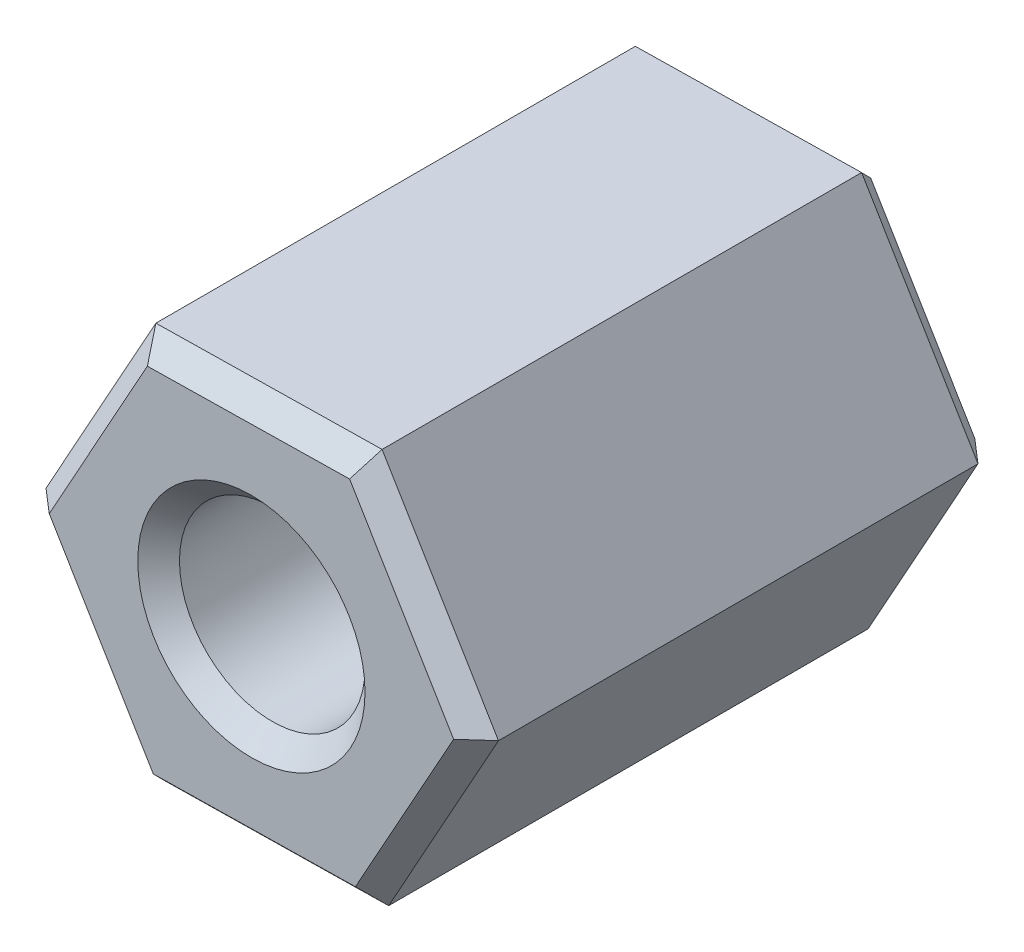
ISO-10303-21;
HEADER;
FILE_DESCRIPTION(('STEP AP214'),'2;1');
FILE_NAME('part.step','',(''),(''),'','','');
FILE_SCHEMA(('AUTOMOTIVE_DESIGN { 1 0 10303 214 1 1 1 1 }'));
ENDSEC;
DATA;
#1=APPLICATION_CONTEXT('core data for automotive mechanical design processes');
#2=APPLICATION_PROTOCOL_DEFINITION('international standard','automotive_design',2000,#1);
#3=PRODUCT_CONTEXT('',#1,'mechanical');
#4=PRODUCT('Part','Part','',(#3));
#5=PRODUCT_RELATED_PRODUCT_CATEGORY('part','',(#4));
#6=PRODUCT_DEFINITION_FORMATION('','',#4);
#7=PRODUCT_DEFINITION_CONTEXT('part definition',#1,'design');
#8=PRODUCT_DEFINITION('design','',#6,#7);
#9=PRODUCT_DEFINITION_SHAPE('','',#8);
#10=(LENGTH_UNIT() NAMED_UNIT(*) SI_UNIT(.MILLI.,.METRE.));
#11=(NAMED_UNIT(*) PLANE_ANGLE_UNIT() SI_UNIT($,.RADIAN.));
#12=(NAMED_UNIT(*) SI_UNIT($,.STERADIAN.) SOLID_ANGLE_UNIT());
#13=UNCERTAINTY_MEASURE_WITH_UNIT(LENGTH_MEASURE(1.E-05),#10,'distance_accuracy_value','');
#14=(GEOMETRIC_REPRESENTATION_CONTEXT(3) GLOBAL_UNCERTAINTY_ASSIGNED_CONTEXT((#13)) GLOBAL_UNIT_ASSIGNED_CONTEXT((#10,
#11,#12)) REPRESENTATION_CONTEXT('',''));
#15=CARTESIAN_POINT('',(0.,0.,0.));
#16=DIRECTION('',(0.,0.,1.));
#17=DIRECTION('',(1.,0.,0.));
#18=AXIS2_PLACEMENT_3D('',#15,#16,#17);
#19=CARTESIAN_POINT('',(1.41824271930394,-2.36419808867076,6.34999999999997));
#20=DIRECTION('',(-0.874271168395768,0.485437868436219,0.));
#21=DIRECTION('',(-0.485437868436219,-0.874271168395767,0.));
#22=AXIS2_PLACEMENT_3D('',#19,#20,#21);
#23=PLANE('',#22);
#24=DIRECTION('',(0.,0.,-1.));
#25=VECTOR('',#24,1.);
#26=CARTESIAN_POINT('',(1.41824271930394,-2.36419808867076,6.34999999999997));
#27=LINE('',#26,#25);
#28=CARTESIAN_POINT('',(1.41824271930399,-2.36419808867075,6.096));
#29=VERTEX_POINT('',#28);
#30=CARTESIAN_POINT('',(1.41824271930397,-2.36419808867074,0.254000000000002));
#31=VERTEX_POINT('',#30);
#32=EDGE_CURVE('E177',#29,#31,#27,.T.);
#33=ORIENTED_EDGE('',*,*,#32,.T.);
#34=DIRECTION('',(0.485437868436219,0.874271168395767,0.));
#35=VECTOR('',#34,1.);
#36=CARTESIAN_POINT('',(1.41824271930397,-2.36419808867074,0.254000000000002));
#37=LINE('',#36,#35);
#38=CARTESIAN_POINT('',(2.75657696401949,0.046135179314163,0.253999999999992));
#39=VERTEX_POINT('',#38);
#40=EDGE_CURVE('E207',#31,#39,#37,.T.);
#41=ORIENTED_EDGE('',*,*,#40,.T.);
#42=DIRECTION('',(0.,0.,-1.));
#43=VECTOR('',#42,1.);
#44=CARTESIAN_POINT('',(2.75657696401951,0.0461351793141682,6.35000000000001));
#45=LINE('',#44,#43);
#46=CARTESIAN_POINT('',(2.75657696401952,0.0461351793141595,6.096));
#47=VERTEX_POINT('',#46);
#48=EDGE_CURVE('E143',#47,#39,#45,.T.);
#49=ORIENTED_EDGE('',*,*,#48,.F.);
#50=DIRECTION('',(-0.485437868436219,-0.874271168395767,0.));
#51=VECTOR('',#50,1.);
#52=CARTESIAN_POINT('',(1.41824271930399,-2.36419808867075,6.096));
#53=LINE('',#52,#51);
#54=EDGE_CURVE('E163',#47,#29,#53,.T.);
#55=ORIENTED_EDGE('',*,*,#54,.T.);
#56=EDGE_LOOP('',(#33,#41,#49,#55));
#57=FACE_BOUND('',#56,.T.);
#58=ADVANCED_FACE('F32',(#57),#23,.F.);
#59=CARTESIAN_POINT('',(2.75657696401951,0.0461351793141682,6.35000000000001));
#60=DIRECTION('',(-0.857537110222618,-0.514422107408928,0.));
#61=DIRECTION('',(0.514422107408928,-0.857537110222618,0.));
#62=AXIS2_PLACEMENT_3D('',#59,#60,#61);
#63=PLANE('',#62);
#64=ORIENTED_EDGE('',*,*,#48,.T.);
#65=DIRECTION('',(-0.514422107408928,0.857537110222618,0.));
#66=VECTOR('',#65,1.);
#67=CARTESIAN_POINT('',(2.75657696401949,0.046135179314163,0.253999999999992));
#68=LINE('',#67,#66);
#69=CARTESIAN_POINT('',(1.33833424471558,2.41033326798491,0.253999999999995));
#70=VERTEX_POINT('',#69);
#71=EDGE_CURVE('E205',#39,#70,#68,.T.);
#72=ORIENTED_EDGE('',*,*,#71,.T.);
#73=DIRECTION('',(0.,0.,-1.));
#74=VECTOR('',#73,1.);
#75=CARTESIAN_POINT('',(1.33833424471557,2.41033326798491,6.35000000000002));
#76=LINE('',#75,#74);
#77=CARTESIAN_POINT('',(1.33833424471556,2.41033326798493,6.09600000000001));
#78=VERTEX_POINT('',#77);
#79=EDGE_CURVE('E251',#78,#70,#76,.T.);
#80=ORIENTED_EDGE('',*,*,#79,.F.);
#81=DIRECTION('',(0.514422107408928,-0.857537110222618,0.));
#82=VECTOR('',#81,1.);
#83=CARTESIAN_POINT('',(2.75657696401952,0.0461351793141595,6.096));
#84=LINE('',#83,#82);
#85=EDGE_CURVE('E161',#78,#47,#84,.T.);
#86=ORIENTED_EDGE('',*,*,#85,.T.);
#87=EDGE_LOOP('',(#64,#72,#80,#86));
#88=FACE_BOUND('',#87,.T.);
#89=ADVANCED_FACE('F250',(#88),#63,.F.);
#90=CARTESIAN_POINT('',(1.33833424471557,2.41033326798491,6.35000000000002));
#91=DIRECTION('',(0.016734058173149,-0.999859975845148,0.));
#92=DIRECTION('',(0.999859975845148,0.0167340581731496,0.));
#93=AXIS2_PLACEMENT_3D('',#90,#91,#92);
#94=PLANE('',#93);
#95=ORIENTED_EDGE('',*,*,#79,.T.);
#96=DIRECTION('',(-0.999859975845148,-0.0167340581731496,0.));
#97=VECTOR('',#96,1.);
#98=CARTESIAN_POINT('',(1.33833424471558,2.41033326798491,0.253999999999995));
#99=LINE('',#98,#97);
#100=CARTESIAN_POINT('',(-1.41824271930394,2.36419808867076,0.253999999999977));
#101=VERTEX_POINT('',#100);
#102=EDGE_CURVE('E202',#70,#101,#99,.T.);
#103=ORIENTED_EDGE('',*,*,#102,.T.);
#104=DIRECTION('',(0.,0.,-1.));
#105=VECTOR('',#104,1.);
#106=CARTESIAN_POINT('',(-1.41824271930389,2.36419808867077,6.35000000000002));
#107=LINE('',#106,#105);
#108=CARTESIAN_POINT('',(-1.4182427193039,2.36419808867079,6.096));
#109=VERTEX_POINT('',#108);
#110=EDGE_CURVE('E258',#109,#101,#107,.T.);
#111=ORIENTED_EDGE('',*,*,#110,.F.);
#112=DIRECTION('',(0.999859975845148,0.0167340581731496,0.));
#113=VECTOR('',#112,1.);
#114=CARTESIAN_POINT('',(1.33833424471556,2.41033326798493,6.09600000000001));
#115=LINE('',#114,#113);
#116=EDGE_CURVE('E159',#109,#78,#115,.T.);
#117=ORIENTED_EDGE('',*,*,#116,.T.);
#118=EDGE_LOOP('',(#95,#103,#111,#117));
#119=FACE_BOUND('',#118,.T.);
#120=ADVANCED_FACE('F255',(#119),#94,.F.);
#121=CARTESIAN_POINT('',(-1.41824271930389,2.36419808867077,6.35000000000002));
#122=DIRECTION('',(0.874271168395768,-0.485437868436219,0.));
#123=DIRECTION('',(0.485437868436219,0.874271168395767,0.));
#124=AXIS2_PLACEMENT_3D('',#121,#122,#123);
#125=PLANE('',#124);
#126=ORIENTED_EDGE('',*,*,#110,.T.);
#127=DIRECTION('',(-0.485437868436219,-0.874271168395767,0.));
#128=VECTOR('',#127,1.);
#129=CARTESIAN_POINT('',(-1.41824271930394,2.36419808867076,0.253999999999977));
#130=LINE('',#129,#128);
#131=CARTESIAN_POINT('',(-2.75657696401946,-0.0461351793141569,0.254000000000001));
#132=VERTEX_POINT('',#131);
#133=EDGE_CURVE('E11',#101,#132,#130,.T.);
#134=ORIENTED_EDGE('',*,*,#133,.T.);
#135=DIRECTION('',(0.,0.,-1.));
#136=VECTOR('',#135,1.);
#137=CARTESIAN_POINT('',(-2.75657696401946,-0.0461351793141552,6.35));
#138=LINE('',#137,#136);
#139=CARTESIAN_POINT('',(-2.75657696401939,-0.046135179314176,6.096));
#140=VERTEX_POINT('',#139);
#141=EDGE_CURVE('E261',#140,#132,#138,.T.);
#142=ORIENTED_EDGE('',*,*,#141,.F.);
#143=DIRECTION('',(0.485437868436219,0.874271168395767,0.));
#144=VECTOR('',#143,1.);
#145=CARTESIAN_POINT('',(-1.4182427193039,2.36419808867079,6.096));
#146=LINE('',#145,#144);
#147=EDGE_CURVE('E157',#140,#109,#146,.T.);
#148=ORIENTED_EDGE('',*,*,#147,.T.);
#149=EDGE_LOOP('',(#126,#134,#142,#148));
#150=FACE_BOUND('',#149,.T.);
#151=ADVANCED_FACE('F455',(#150),#125,.F.);
#152=CARTESIAN_POINT('',(-2.75657696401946,-0.0461351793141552,6.35));
#153=DIRECTION('',(0.857537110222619,0.514422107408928,0.));
#154=DIRECTION('',(-0.514422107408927,0.857537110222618,0.));
#155=AXIS2_PLACEMENT_3D('',#152,#153,#154);
#156=PLANE('',#155);
#157=ORIENTED_EDGE('',*,*,#141,.T.);
#158=DIRECTION('',(0.514422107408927,-0.857537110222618,0.));
#159=VECTOR('',#158,1.);
#160=CARTESIAN_POINT('',(-2.75657696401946,-0.0461351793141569,0.254000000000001));
#161=LINE('',#160,#159);
#162=CARTESIAN_POINT('',(-1.33833424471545,-2.41033326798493,0.253999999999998));
#163=VERTEX_POINT('',#162);
#164=EDGE_CURVE('E41',#132,#163,#161,.T.);
#165=ORIENTED_EDGE('',*,*,#164,.T.);
#166=DIRECTION('',(0.,0.,-1.));
#167=VECTOR('',#166,1.);
#168=CARTESIAN_POINT('',(-1.33833424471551,-2.41033326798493,6.35));
#169=LINE('',#168,#167);
#170=CARTESIAN_POINT('',(-1.33833424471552,-2.41033326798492,6.09599999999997));
#171=VERTEX_POINT('',#170);
#172=EDGE_CURVE('E280',#171,#163,#169,.T.);
#173=ORIENTED_EDGE('',*,*,#172,.F.);
#174=DIRECTION('',(-0.514422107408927,0.857537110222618,0.));
#175=VECTOR('',#174,1.);
#176=CARTESIAN_POINT('',(-2.75657696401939,-0.046135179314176,6.096));
#177=LINE('',#176,#175);
#178=EDGE_CURVE('E150',#171,#140,#177,.T.);
#179=ORIENTED_EDGE('',*,*,#178,.T.);
#180=EDGE_LOOP('',(#157,#165,#173,#179));
#181=FACE_BOUND('',#180,.T.);
#182=ADVANCED_FACE('F282',(#181),#156,.F.);
#183=CARTESIAN_POINT('',(-1.33833424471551,-2.41033326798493,6.35));
#184=DIRECTION('',(-0.016734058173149,0.999859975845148,0.));
#185=DIRECTION('',(-0.999859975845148,-0.01673405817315,0.));
#186=AXIS2_PLACEMENT_3D('',#183,#184,#185);
#187=PLANE('',#186);
#188=ORIENTED_EDGE('',*,*,#172,.T.);
#189=DIRECTION('',(0.999859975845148,0.01673405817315,0.));
#190=VECTOR('',#189,1.);
#191=CARTESIAN_POINT('',(-1.33833424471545,-2.41033326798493,0.253999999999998));
#192=LINE('',#191,#190);
#193=EDGE_CURVE('E209',#163,#31,#192,.T.);
#194=ORIENTED_EDGE('',*,*,#193,.T.);
#195=ORIENTED_EDGE('',*,*,#32,.F.);
#196=DIRECTION('',(-0.999859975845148,-0.01673405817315,0.));
#197=VECTOR('',#196,1.);
#198=CARTESIAN_POINT('',(-1.33833424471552,-2.41033326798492,6.09599999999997));
#199=LINE('',#198,#197);
#200=EDGE_CURVE('E130',#29,#171,#199,.T.);
#201=ORIENTED_EDGE('',*,*,#200,.T.);
#202=EDGE_LOOP('',(#188,#194,#195,#201));
#203=FACE_BOUND('',#202,.T.);
#204=ADVANCED_FACE('F279',(#203),#187,.F.);
#205=CARTESIAN_POINT('',(2.75657696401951,0.0461351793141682,6.35000000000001));
#206=DIRECTION('',(0.,0.,1.));
#207=DIRECTION('',(1.,0.,0.));
#208=AXIS2_PLACEMENT_3D('',#205,#206,#207);
#209=PLANE('',#208);
#210=CARTESIAN_POINT('',(0.,0.,6.35));
#211=DIRECTION('',(0.,0.,1.));
#212=DIRECTION('',(1.,0.,0.));
#213=AXIS2_PLACEMENT_3D('',#210,#211,#212);
#214=CIRCLE('',#213,1.3843);
#215=CARTESIAN_POINT('',(1.3843,0.,6.35));
#216=VERTEX_POINT('',#215);
#217=EDGE_CURVE('E164',#216,#216,#214,.F.);
#218=ORIENTED_EDGE('',*,*,#217,.T.);
#219=EDGE_LOOP('',(#218));
#220=FACE_BOUND('',#219,.T.);
#221=DIRECTION('',(0.514422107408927,-0.857537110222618,0.));
#222=VECTOR('',#221,1.);
#223=CARTESIAN_POINT('',(-1.12051981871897,-2.27967005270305,6.34999999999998));
#224=LINE('',#223,#222);
#225=CARTESIAN_POINT('',(-2.46332409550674,-0.0412271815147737,6.35));
#226=VERTEX_POINT('',#225);
#227=CARTESIAN_POINT('',(-1.19595826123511,-2.15391483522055,6.35000000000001));
#228=VERTEX_POINT('',#227);
#229=EDGE_CURVE('E147',#226,#228,#224,.T.);
#230=ORIENTED_EDGE('',*,*,#229,.T.);
#231=DIRECTION('',(0.999859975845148,0.01673405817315,0.));
#232=VECTOR('',#231,1.);
#233=CARTESIAN_POINT('',(1.41399226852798,-2.11023365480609,6.35000000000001));
#234=LINE('',#233,#232);
#235=CARTESIAN_POINT('',(1.26736583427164,-2.11268765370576,6.35));
#236=VERTEX_POINT('',#235);
#237=EDGE_CURVE('E128',#228,#236,#234,.T.);
#238=ORIENTED_EDGE('',*,*,#237,.T.);
#239=DIRECTION('',(0.485437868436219,0.874271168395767,0.));
#240=VECTOR('',#239,1.);
#241=CARTESIAN_POINT('',(2.53451208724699,0.169436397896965,6.35));
#242=LINE('',#241,#240);
#243=CARTESIAN_POINT('',(2.46332409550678,0.0412271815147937,6.35));
#244=VERTEX_POINT('',#243);
#245=EDGE_CURVE('E136',#236,#244,#242,.T.);
#246=ORIENTED_EDGE('',*,*,#245,.T.);
#247=DIRECTION('',(-0.514422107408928,0.857537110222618,0.));
#248=VECTOR('',#247,1.);
#249=CARTESIAN_POINT('',(1.12051981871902,2.27967005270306,6.35));
#250=LINE('',#249,#248);
#251=CARTESIAN_POINT('',(1.19595826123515,2.15391483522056,6.35));
#252=VERTEX_POINT('',#251);
#253=EDGE_CURVE('E142',#244,#252,#250,.T.);
#254=ORIENTED_EDGE('',*,*,#253,.T.);
#255=DIRECTION('',(-0.999859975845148,-0.0167340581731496,0.));
#256=VECTOR('',#255,1.);
#257=CARTESIAN_POINT('',(-1.41399226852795,2.11023365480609,6.35));
#258=LINE('',#257,#256);
#259=CARTESIAN_POINT('',(-1.26736583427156,2.1126876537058,6.35));
#260=VERTEX_POINT('',#259);
#261=EDGE_CURVE('E266',#252,#260,#258,.T.);
#262=ORIENTED_EDGE('',*,*,#261,.T.);
#263=DIRECTION('',(-0.485437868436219,-0.874271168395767,0.));
#264=VECTOR('',#263,1.);
#265=CARTESIAN_POINT('',(-2.53451208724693,-0.169436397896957,6.35));
#266=LINE('',#265,#264);
#267=EDGE_CURVE('E152',#260,#226,#266,.T.);
#268=ORIENTED_EDGE('',*,*,#267,.T.);
#269=EDGE_LOOP('',(#230,#238,#246,#254,#262,#268));
#270=FACE_BOUND('',#269,.T.);
#271=ADVANCED_FACE('F145',(#220,#270),#209,.T.);
#272=CARTESIAN_POINT('',(2.75657696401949,0.046135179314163,0.));
#273=DIRECTION('',(0.,0.,1.));
#274=DIRECTION('',(1.,0.,0.));
#275=AXIS2_PLACEMENT_3D('',#272,#273,#274);
#276=PLANE('',#275);
#277=CARTESIAN_POINT('',(0.,0.,0.));
#278=DIRECTION('',(0.,0.,1.));
#279=DIRECTION('',(1.,0.,0.));
#280=AXIS2_PLACEMENT_3D('',#277,#278,#279);
#281=CIRCLE('',#280,1.38429999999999);
#282=CARTESIAN_POINT('',(1.38429999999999,0.,0.));
#283=VERTEX_POINT('',#282);
#284=EDGE_CURVE('E199',#283,#283,#281,.T.);
#285=ORIENTED_EDGE('',*,*,#284,.T.);
#286=EDGE_LOOP('',(#285));
#287=FACE_BOUND('',#286,.T.);
#288=DIRECTION('',(0.485437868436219,0.874271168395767,0.));
#289=VECTOR('',#288,1.);
#290=CARTESIAN_POINT('',(-1.19617784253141,2.24089687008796,0.));
#291=LINE('',#290,#289);
#292=CARTESIAN_POINT('',(-2.4633240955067,-0.0412271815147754,0.));
#293=VERTEX_POINT('',#292);
#294=CARTESIAN_POINT('',(-1.26736583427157,2.1126876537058,0.));
#295=VERTEX_POINT('',#294);
#296=EDGE_CURVE('E186',#293,#295,#291,.T.);
#297=ORIENTED_EDGE('',*,*,#296,.T.);
#298=DIRECTION('',(0.999859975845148,0.0167340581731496,0.));
#299=VECTOR('',#298,1.);
#300=CARTESIAN_POINT('',(2.72087317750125,2.17943642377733,0.));
#301=LINE('',#300,#299);
#302=CARTESIAN_POINT('',(1.19595826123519,2.15391483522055,0.));
#303=VERTEX_POINT('',#302);
#304=EDGE_CURVE('E196',#295,#303,#301,.T.);
#305=ORIENTED_EDGE('',*,*,#304,.T.);
#306=DIRECTION('',(0.514422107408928,-0.857537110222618,0.));
#307=VECTOR('',#306,1.);
#308=CARTESIAN_POINT('',(2.53876253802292,-0.0845280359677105,0.));
#309=LINE('',#308,#307);
#310=CARTESIAN_POINT('',(2.46332409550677,0.0412271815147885,0.));
#311=VERTEX_POINT('',#310);
#312=EDGE_CURVE('E194',#303,#311,#309,.T.);
#313=ORIENTED_EDGE('',*,*,#312,.T.);
#314=DIRECTION('',(-0.485437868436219,-0.874271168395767,0.));
#315=VECTOR('',#314,1.);
#316=CARTESIAN_POINT('',(2.53451208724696,0.169436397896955,0.));
#317=LINE('',#316,#315);
#318=CARTESIAN_POINT('',(1.2673658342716,-2.11268765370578,0.));
#319=VERTEX_POINT('',#318);
#320=EDGE_CURVE('E192',#311,#319,#317,.T.);
#321=ORIENTED_EDGE('',*,*,#320,.T.);
#322=DIRECTION('',(-0.999859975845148,-0.01673405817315,0.));
#323=VECTOR('',#322,1.);
#324=CARTESIAN_POINT('',(2.79228075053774,-2.087166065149,0.));
#325=LINE('',#324,#323);
#326=CARTESIAN_POINT('',(-1.19595826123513,-2.15391483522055,0.));
#327=VERTEX_POINT('',#326);
#328=EDGE_CURVE('E190',#319,#327,#325,.T.);
#329=ORIENTED_EDGE('',*,*,#328,.T.);
#330=DIRECTION('',(-0.514422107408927,0.857537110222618,0.));
#331=VECTOR('',#330,1.);
#332=CARTESIAN_POINT('',(-1.12051981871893,-2.27967005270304,0.));
#333=LINE('',#332,#331);
#334=EDGE_CURVE('E188',#327,#293,#333,.T.);
#335=ORIENTED_EDGE('',*,*,#334,.T.);
#336=EDGE_LOOP('',(#297,#305,#313,#321,#329,#335));
#337=FACE_BOUND('',#336,.T.);
#338=ADVANCED_FACE('F237',(#287,#337),#276,.F.);
#339=CARTESIAN_POINT('',(0.,0.,0.));
#340=DIRECTION('',(0.,0.,-1.));
#341=DIRECTION('',(-1.,0.,0.));
#342=AXIS2_PLACEMENT_3D('',#339,#340,#341);
#343=CYLINDRICAL_SURFACE('',#342,1.13029999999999);
#344=CARTESIAN_POINT('',(0.,0.,0.253999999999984));
#345=DIRECTION('',(0.,0.,1.));
#346=DIRECTION('',(1.,0.,0.));
#347=AXIS2_PLACEMENT_3D('',#344,#345,#346);
#348=CIRCLE('',#347,1.13029999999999);
#349=CARTESIAN_POINT('',(1.13030000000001,0.,0.253999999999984));
#350=VERTEX_POINT('',#349);
#351=EDGE_CURVE('E183',#350,#350,#348,.F.);
#352=ORIENTED_EDGE('',*,*,#351,.T.);
#353=EDGE_LOOP('',(#352));
#354=FACE_BOUND('',#353,.T.);
#355=CARTESIAN_POINT('',(0.,0.,6.09599999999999));
#356=DIRECTION('',(0.,0.,1.));
#357=DIRECTION('',(1.,0.,0.));
#358=AXIS2_PLACEMENT_3D('',#355,#356,#357);
#359=CIRCLE('',#358,1.13029999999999);
#360=CARTESIAN_POINT('',(1.13030000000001,0.,6.09599999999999));
#361=VERTEX_POINT('',#360);
#362=EDGE_CURVE('E180',#361,#361,#359,.T.);
#363=ORIENTED_EDGE('',*,*,#362,.T.);
#364=EDGE_LOOP('',(#363));
#365=FACE_BOUND('',#364,.T.);
#366=ADVANCED_FACE('F292',(#354,#365),#343,.F.);
#367=CARTESIAN_POINT('',(2.72087317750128,2.17943642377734,6.34999999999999));
#368=DIRECTION('',(-0.0118327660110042,0.707007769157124,0.707106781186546));
#369=DIRECTION('',(0.,-0.707156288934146,0.707057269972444));
#370=AXIS2_PLACEMENT_3D('',#367,#368,#369);
#371=PLANE('',#370);
#372=DIRECTION('',(-0.366956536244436,-0.660886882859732,0.654653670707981));
#373=VECTOR('',#372,1.);
#374=CARTESIAN_POINT('',(0.833916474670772,1.5018793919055,6.99588571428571));
#375=LINE('',#374,#373);
#376=EDGE_CURVE('E171',#78,#252,#375,.T.);
#377=ORIENTED_EDGE('',*,*,#376,.F.);
#378=ORIENTED_EDGE('',*,*,#116,.F.);
#379=DIRECTION('',(0.388866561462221,-0.648237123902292,0.654653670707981));
#380=VECTOR('',#379,1.);
#381=CARTESIAN_POINT('',(-0.681101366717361,1.1353899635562,7.33697142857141));
#382=LINE('',#381,#380);
#383=EDGE_CURVE('E174',#260,#109,#382,.F.);
#384=ORIENTED_EDGE('',*,*,#383,.F.);
#385=ORIENTED_EDGE('',*,*,#261,.F.);
#386=EDGE_LOOP('',(#377,#378,#384,#385));
#387=FACE_BOUND('',#386,.T.);
#388=ADVANCED_FACE('F290',(#387),#371,.T.);
#389=CARTESIAN_POINT('',(-1.19617784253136,2.24089687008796,6.35));
#390=DIRECTION('',(-0.618203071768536,0.343256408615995,0.707106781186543));
#391=DIRECTION('',(0.752848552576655,0.,0.658193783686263));
#392=AXIS2_PLACEMENT_3D('',#389,#390,#391);
#393=PLANE('',#392);
#394=ORIENTED_EDGE('',*,*,#383,.T.);
#395=ORIENTED_EDGE('',*,*,#147,.F.);
#396=DIRECTION('',(0.755823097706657,0.0126497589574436,0.654653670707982));
#397=VECTOR('',#396,1.);
#398=CARTESIAN_POINT('',(-1.71762394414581,-0.028746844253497,6.9958857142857));
#399=LINE('',#398,#397);
#400=EDGE_CURVE('E168',#226,#140,#399,.F.);
#401=ORIENTED_EDGE('',*,*,#400,.F.);
#402=ORIENTED_EDGE('',*,*,#267,.F.);
#403=EDGE_LOOP('',(#394,#395,#401,#402));
#404=FACE_BOUND('',#403,.T.);
#405=ADVANCED_FACE('F273',(#404),#393,.T.);
#406=CARTESIAN_POINT('',(2.53876253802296,-0.0845280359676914,6.35));
#407=DIRECTION('',(0.606370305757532,0.363751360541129,0.707106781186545));
#408=DIRECTION('',(0.75910870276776,0.,-0.65096388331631));
#409=AXIS2_PLACEMENT_3D('',#406,#407,#408);
#410=PLANE('',#409);
#411=ORIENTED_EDGE('',*,*,#376,.T.);
#412=ORIENTED_EDGE('',*,*,#253,.F.);
#413=DIRECTION('',(-0.755823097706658,-0.0126497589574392,0.65465367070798));
#414=VECTOR('',#413,1.);
#415=CARTESIAN_POINT('',(2.50521736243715,0.0419283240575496,6.31371428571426));
#416=LINE('',#415,#414);
#417=EDGE_CURVE('E139',#47,#244,#416,.T.);
#418=ORIENTED_EDGE('',*,*,#417,.F.);
#419=ORIENTED_EDGE('',*,*,#85,.F.);
#420=EDGE_LOOP('',(#411,#412,#418,#419));
#421=FACE_BOUND('',#420,.T.);
#422=ADVANCED_FACE('F288',(#421),#410,.T.);
#423=CARTESIAN_POINT('',(-1.12051981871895,-2.27967005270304,6.34999999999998));
#424=DIRECTION('',(-0.606370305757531,-0.363751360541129,0.707106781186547));
#425=DIRECTION('',(0.759108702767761,0.,0.650963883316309));
#426=AXIS2_PLACEMENT_3D('',#423,#424,#425);
#427=PLANE('',#426);
#428=ORIENTED_EDGE('',*,*,#400,.T.);
#429=ORIENTED_EDGE('',*,*,#178,.F.);
#430=DIRECTION('',(0.366956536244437,0.660886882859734,0.654653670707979));
#431=VECTOR('',#430,1.);
#432=CARTESIAN_POINT('',(-1.2162976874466,-2.19054603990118,6.31371428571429));
#433=LINE('',#432,#431);
#434=EDGE_CURVE('E133',#228,#171,#433,.F.);
#435=ORIENTED_EDGE('',*,*,#434,.F.);
#436=ORIENTED_EDGE('',*,*,#229,.F.);
#437=EDGE_LOOP('',(#428,#429,#435,#436));
#438=FACE_BOUND('',#437,.T.);
#439=ADVANCED_FACE('F276',(#438),#427,.T.);
#440=CARTESIAN_POINT('',(2.53451208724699,0.169436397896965,6.35));
#441=DIRECTION('',(0.618203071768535,-0.343256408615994,0.707106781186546));
#442=DIRECTION('',(0.752848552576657,0.,-0.658193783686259));
#443=AXIS2_PLACEMENT_3D('',#440,#441,#442);
#444=PLANE('',#443);
#445=ORIENTED_EDGE('',*,*,#417,.T.);
#446=ORIENTED_EDGE('',*,*,#245,.F.);
#447=DIRECTION('',(0.388866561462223,-0.648237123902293,-0.654653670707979));
#448=VECTOR('',#447,1.);
#449=CARTESIAN_POINT('',(0.883707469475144,-1.47313254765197,6.9958857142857));
#450=LINE('',#449,#448);
#451=EDGE_CURVE('E124',#29,#236,#450,.F.);
#452=ORIENTED_EDGE('',*,*,#451,.F.);
#453=ORIENTED_EDGE('',*,*,#54,.F.);
#454=EDGE_LOOP('',(#445,#446,#452,#453));
#455=FACE_BOUND('',#454,.T.);
#456=ADVANCED_FACE('F137',(#455),#444,.T.);
#457=CARTESIAN_POINT('',(2.79228075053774,-2.087166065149,6.35000000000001));
#458=DIRECTION('',(0.0118327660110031,-0.707007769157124,0.707106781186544));
#459=DIRECTION('',(0.,-0.707156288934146,-0.707057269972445));
#460=AXIS2_PLACEMENT_3D('',#457,#458,#459);
#461=PLANE('',#460);
#462=ORIENTED_EDGE('',*,*,#434,.T.);
#463=ORIENTED_EDGE('',*,*,#200,.F.);
#464=ORIENTED_EDGE('',*,*,#451,.T.);
#465=ORIENTED_EDGE('',*,*,#237,.F.);
#466=EDGE_LOOP('',(#462,#463,#464,#465));
#467=FACE_BOUND('',#466,.T.);
#468=ADVANCED_FACE('F126',(#467),#461,.T.);
#469=CARTESIAN_POINT('',(0.,0.,6.35));
#470=DIRECTION('',(0.,0.,1.));
#471=DIRECTION('',(1.,0.,0.));
#472=AXIS2_PLACEMENT_3D('',#469,#470,#471);
#473=CONICAL_SURFACE('',#472,1.3843,0.785398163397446);
#474=ORIENTED_EDGE('',*,*,#362,.F.);
#475=EDGE_LOOP('',(#474));
#476=FACE_BOUND('',#475,.T.);
#477=ORIENTED_EDGE('',*,*,#217,.F.);
#478=EDGE_LOOP('',(#477));
#479=FACE_BOUND('',#478,.T.);
#480=ADVANCED_FACE('F312',(#476,#479),#473,.F.);
#481=CARTESIAN_POINT('',(0.,0.,0.253999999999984));
#482=DIRECTION('',(0.,0.,-1.));
#483=DIRECTION('',(-1.,0.,0.));
#484=AXIS2_PLACEMENT_3D('',#481,#482,#483);
#485=CONICAL_SURFACE('',#484,1.13029999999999,0.78539816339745);
#486=ORIENTED_EDGE('',*,*,#284,.F.);
#487=EDGE_LOOP('',(#486));
#488=FACE_BOUND('',#487,.T.);
#489=ORIENTED_EDGE('',*,*,#351,.F.);
#490=EDGE_LOOP('',(#489));
#491=FACE_BOUND('',#490,.T.);
#492=ADVANCED_FACE('F340',(#488,#491),#485,.F.);
#493=CARTESIAN_POINT('',(-1.33833424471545,-2.41033326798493,0.253999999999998));
#494=DIRECTION('',(-0.0118327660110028,0.707007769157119,0.707106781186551));
#495=DIRECTION('',(0.,-0.70715628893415,0.707057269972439));
#496=AXIS2_PLACEMENT_3D('',#493,#494,#495);
#497=PLANE('',#496);
#498=DIRECTION('',(-0.366956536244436,-0.660886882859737,0.654653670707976));
#499=VECTOR('',#498,1.);
#500=CARTESIAN_POINT('',(-0.955953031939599,-1.7216666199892,-0.428171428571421));
#501=LINE('',#500,#499);
#502=EDGE_CURVE('E221',#327,#163,#501,.T.);
#503=ORIENTED_EDGE('',*,*,#502,.F.);
#504=ORIENTED_EDGE('',*,*,#328,.F.);
#505=DIRECTION('',(0.388866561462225,-0.648237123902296,0.654653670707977));
#506=VECTOR('',#505,1.);
#507=CARTESIAN_POINT('',(1.01303051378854,-1.6887129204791,-0.428171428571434));
#508=LINE('',#507,#506);
#509=EDGE_CURVE('E36',#31,#319,#508,.F.);
#510=ORIENTED_EDGE('',*,*,#509,.F.);
#511=ORIENTED_EDGE('',*,*,#193,.F.);
#512=EDGE_LOOP('',(#503,#504,#510,#511));
#513=FACE_BOUND('',#512,.T.);
#514=ADVANCED_FACE('F34',(#513),#497,.F.);
#515=CARTESIAN_POINT('',(1.41824271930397,-2.36419808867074,0.254000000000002));
#516=DIRECTION('',(-0.618203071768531,0.343256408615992,0.707106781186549));
#517=DIRECTION('',(0.752848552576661,0.,0.658193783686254));
#518=AXIS2_PLACEMENT_3D('',#515,#516,#517);
#519=PLANE('',#518);
#520=ORIENTED_EDGE('',*,*,#509,.T.);
#521=ORIENTED_EDGE('',*,*,#320,.F.);
#522=DIRECTION('',(0.755823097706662,0.01264975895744,0.654653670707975));
#523=VECTOR('',#522,1.);
#524=CARTESIAN_POINT('',(1.96898354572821,0.0329536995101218,-0.428171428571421));
#525=LINE('',#524,#523);
#526=EDGE_CURVE('E219',#39,#311,#525,.F.);
#527=ORIENTED_EDGE('',*,*,#526,.F.);
#528=ORIENTED_EDGE('',*,*,#40,.F.);
#529=EDGE_LOOP('',(#520,#521,#527,#528));
#530=FACE_BOUND('',#529,.T.);
#531=ADVANCED_FACE('F231',(#530),#519,.F.);
#532=CARTESIAN_POINT('',(-2.75657696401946,-0.0461351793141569,0.254000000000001));
#533=DIRECTION('',(0.606370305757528,0.363751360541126,0.70710678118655));
#534=DIRECTION('',(0.759108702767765,0.,-0.650963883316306));
#535=AXIS2_PLACEMENT_3D('',#532,#533,#534);
#536=PLANE('',#535);
#537=ORIENTED_EDGE('',*,*,#502,.T.);
#538=ORIENTED_EDGE('',*,*,#164,.F.);
#539=DIRECTION('',(-0.755823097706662,-0.0126497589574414,0.654653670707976));
#540=VECTOR('',#539,1.);
#541=CARTESIAN_POINT('',(-1.96898354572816,-0.0329536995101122,-0.428171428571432));
#542=LINE('',#541,#540);
#543=EDGE_CURVE('E216',#293,#132,#542,.T.);
#544=ORIENTED_EDGE('',*,*,#543,.F.);
#545=ORIENTED_EDGE('',*,*,#334,.F.);
#546=EDGE_LOOP('',(#537,#538,#544,#545));
#547=FACE_BOUND('',#546,.T.);
#548=ADVANCED_FACE('F359',(#547),#536,.F.);
#549=CARTESIAN_POINT('',(2.75657696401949,0.046135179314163,0.253999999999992));
#550=DIRECTION('',(-0.606370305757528,-0.363751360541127,0.70710678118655));
#551=DIRECTION('',(0.759108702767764,0.,0.650963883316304));
#552=AXIS2_PLACEMENT_3D('',#549,#550,#551);
#553=PLANE('',#552);
#554=ORIENTED_EDGE('',*,*,#526,.T.);
#555=ORIENTED_EDGE('',*,*,#312,.F.);
#556=DIRECTION('',(0.366956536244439,0.660886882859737,0.654653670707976));
#557=VECTOR('',#556,1.);
#558=CARTESIAN_POINT('',(0.955953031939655,1.72166661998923,-0.428171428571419));
#559=LINE('',#558,#557);
#560=EDGE_CURVE('E214',#70,#303,#559,.F.);
#561=ORIENTED_EDGE('',*,*,#560,.F.);
#562=ORIENTED_EDGE('',*,*,#71,.F.);
#563=EDGE_LOOP('',(#554,#555,#561,#562));
#564=FACE_BOUND('',#563,.T.);
#565=ADVANCED_FACE('F243',(#564),#553,.F.);
#566=CARTESIAN_POINT('',(-1.41824271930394,2.36419808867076,0.253999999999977));
#567=DIRECTION('',(0.618203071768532,-0.343256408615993,0.70710678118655));
#568=DIRECTION('',(0.75284855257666,0.,-0.658193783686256));
#569=AXIS2_PLACEMENT_3D('',#566,#567,#568);
#570=PLANE('',#569);
#571=ORIENTED_EDGE('',*,*,#543,.T.);
#572=ORIENTED_EDGE('',*,*,#133,.F.);
#573=DIRECTION('',(0.388866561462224,-0.648237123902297,-0.654653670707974));
#574=VECTOR('',#573,1.);
#575=CARTESIAN_POINT('',(-1.41824271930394,2.36419808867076,0.253999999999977));
#576=LINE('',#575,#574);
#577=EDGE_CURVE('E212',#295,#101,#576,.F.);
#578=ORIENTED_EDGE('',*,*,#577,.F.);
#579=ORIENTED_EDGE('',*,*,#296,.F.);
#580=EDGE_LOOP('',(#571,#572,#578,#579));
#581=FACE_BOUND('',#580,.T.);
#582=ADVANCED_FACE('F371',(#581),#570,.F.);
#583=CARTESIAN_POINT('',(1.33833424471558,2.41033326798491,0.253999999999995));
#584=DIRECTION('',(0.0118327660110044,-0.707007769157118,0.707106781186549));
#585=DIRECTION('',(0.,-0.70715628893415,-0.707057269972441));
#586=AXIS2_PLACEMENT_3D('',#583,#584,#585);
#587=PLANE('',#586);
#588=ORIENTED_EDGE('',*,*,#560,.T.);
#589=ORIENTED_EDGE('',*,*,#304,.F.);
#590=ORIENTED_EDGE('',*,*,#577,.T.);
#591=ORIENTED_EDGE('',*,*,#102,.F.);
#592=EDGE_LOOP('',(#588,#589,#590,#591));
#593=FACE_BOUND('',#592,.T.);
#594=ADVANCED_FACE('F378',(#593),#587,.F.);
#595=CLOSED_SHELL('',(#58,#89,#120,#151,#182,#204,#271,#338,#366,#388,#405,#422,#439,#456,#468,
#480,#492,#514,#531,#548,#565,#582,#594));
#596=MANIFOLD_SOLID_BREP('B2',#595);
#597=ADVANCED_BREP_SHAPE_REPRESENTATION('',(#18,#596),#14);
#598=SHAPE_DEFINITION_REPRESENTATION(#9,#597);
ENDSEC;
END-ISO-10303-21;
